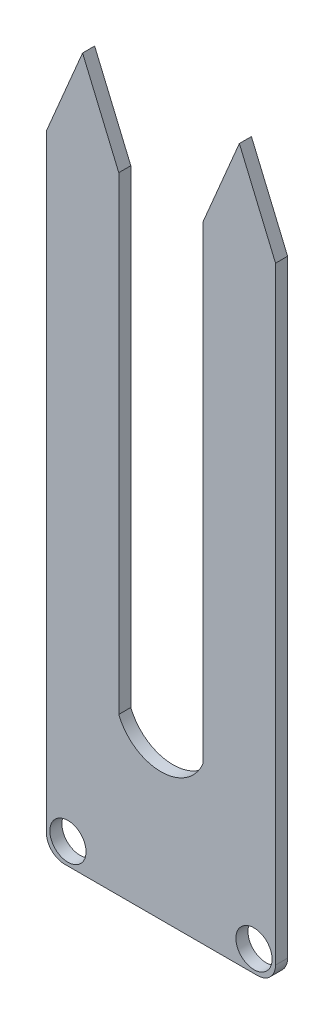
ISO-10303-21;
HEADER;
FILE_DESCRIPTION(('STEP AP214'),'2;1');
FILE_NAME('part.step','',(''),(''),'','','');
FILE_SCHEMA(('AUTOMOTIVE_DESIGN { 1 0 10303 214 1 1 1 1 }'));
ENDSEC;
DATA;
#1=APPLICATION_CONTEXT('core data for automotive mechanical design processes');
#2=APPLICATION_PROTOCOL_DEFINITION('international standard','automotive_design',2000,#1);
#3=PRODUCT_CONTEXT('',#1,'mechanical');
#4=PRODUCT('Part','Part','',(#3));
#5=PRODUCT_RELATED_PRODUCT_CATEGORY('part','',(#4));
#6=PRODUCT_DEFINITION_FORMATION('','',#4);
#7=PRODUCT_DEFINITION_CONTEXT('part definition',#1,'design');
#8=PRODUCT_DEFINITION('design','',#6,#7);
#9=PRODUCT_DEFINITION_SHAPE('','',#8);
#10=(LENGTH_UNIT() NAMED_UNIT(*) SI_UNIT(.MILLI.,.METRE.));
#11=(NAMED_UNIT(*) PLANE_ANGLE_UNIT() SI_UNIT($,.RADIAN.));
#12=(NAMED_UNIT(*) SI_UNIT($,.STERADIAN.) SOLID_ANGLE_UNIT());
#13=UNCERTAINTY_MEASURE_WITH_UNIT(LENGTH_MEASURE(1.E-05),#10,'distance_accuracy_value','');
#14=(GEOMETRIC_REPRESENTATION_CONTEXT(3) GLOBAL_UNCERTAINTY_ASSIGNED_CONTEXT((#13)) GLOBAL_UNIT_ASSIGNED_CONTEXT((#10,
#11,#12)) REPRESENTATION_CONTEXT('',''));
#15=CARTESIAN_POINT('',(0.,0.,0.));
#16=DIRECTION('',(0.,0.,1.));
#17=DIRECTION('',(1.,0.,0.));
#18=AXIS2_PLACEMENT_3D('',#15,#16,#17);
#19=CARTESIAN_POINT('',(-0.939393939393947,-18.4006283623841,1.));
#20=DIRECTION('',(0.,0.,1.));
#21=DIRECTION('',(1.,0.,0.));
#22=AXIS2_PLACEMENT_3D('',#19,#20,#21);
#23=PLANE('',#22);
#24=CARTESIAN_POINT('',(-8.65222968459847,-31.0226398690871,1.));
#25=DIRECTION('',(0.,0.,1.));
#26=DIRECTION('',(1.,0.,0.));
#27=AXIS2_PLACEMENT_3D('',#24,#25,#26);
#28=CIRCLE('',#27,1.50057310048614);
#29=CARTESIAN_POINT('',(-7.15165658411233,-31.0226398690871,1.));
#30=VERTEX_POINT('',#29);
#31=EDGE_CURVE('E158',#30,#30,#28,.T.);
#32=ORIENTED_EDGE('',*,*,#31,.F.);
#33=EDGE_LOOP('',(#32));
#34=FACE_BOUND('',#33,.T.);
#35=DIRECTION('',(0.,-1.,0.));
#36=VECTOR('',#35,1.);
#37=CARTESIAN_POINT('',(-10.4393939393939,-19.8030303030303,1.));
#38=LINE('',#37,#36);
#39=CARTESIAN_POINT('',(-10.4393939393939,19.1012573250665,1.));
#40=VERTEX_POINT('',#39);
#41=CARTESIAN_POINT('',(-10.4393939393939,-31.3030303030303,1.));
#42=VERTEX_POINT('',#41);
#43=EDGE_CURVE('E106',#40,#42,#38,.T.);
#44=ORIENTED_EDGE('',*,*,#43,.T.);
#45=CARTESIAN_POINT('',(-8.93939393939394,-31.3030303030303,1.));
#46=DIRECTION('',(0.,0.,1.));
#47=DIRECTION('',(1.,0.,0.));
#48=AXIS2_PLACEMENT_3D('',#45,#46,#47);
#49=CIRCLE('',#48,1.5);
#50=CARTESIAN_POINT('',(-8.93939393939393,-32.8030303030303,1.));
#51=VERTEX_POINT('',#50);
#52=EDGE_CURVE('E247',#42,#51,#49,.T.);
#53=ORIENTED_EDGE('',*,*,#52,.T.);
#54=DIRECTION('',(1.,0.,0.));
#55=VECTOR('',#54,1.);
#56=CARTESIAN_POINT('',(-8.93939393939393,-32.8030303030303,1.));
#57=LINE('',#56,#55);
#58=CARTESIAN_POINT('',(7.06060606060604,-32.8030303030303,1.));
#59=VERTEX_POINT('',#58);
#60=EDGE_CURVE('E207',#51,#59,#57,.T.);
#61=ORIENTED_EDGE('',*,*,#60,.T.);
#62=CARTESIAN_POINT('',(7.06060606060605,-31.3030303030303,1.));
#63=DIRECTION('',(0.,0.,1.));
#64=DIRECTION('',(1.,0.,0.));
#65=AXIS2_PLACEMENT_3D('',#62,#63,#64);
#66=CIRCLE('',#65,1.5);
#67=CARTESIAN_POINT('',(8.56060606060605,-31.3030303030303,1.));
#68=VERTEX_POINT('',#67);
#69=EDGE_CURVE('E225',#59,#68,#66,.T.);
#70=ORIENTED_EDGE('',*,*,#69,.T.);
#71=DIRECTION('',(0.,1.,0.));
#72=VECTOR('',#71,1.);
#73=CARTESIAN_POINT('',(8.56060606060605,-19.8030303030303,1.));
#74=LINE('',#73,#72);
#75=CARTESIAN_POINT('',(8.56060606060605,19.1012573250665,1.));
#76=VERTEX_POINT('',#75);
#77=EDGE_CURVE('E222',#68,#76,#74,.T.);
#78=ORIENTED_EDGE('',*,*,#77,.T.);
#79=DIRECTION('',(-0.389416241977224,0.921061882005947,0.));
#80=VECTOR('',#79,1.);
#81=CARTESIAN_POINT('',(8.56060606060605,19.1012573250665,1.));
#82=LINE('',#81,#80);
#83=CARTESIAN_POINT('',(5.56060606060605,26.1969696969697,1.));
#84=VERTEX_POINT('',#83);
#85=EDGE_CURVE('E224',#76,#84,#82,.T.);
#86=ORIENTED_EDGE('',*,*,#85,.T.);
#87=DIRECTION('',(-0.389416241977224,-0.921061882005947,0.));
#88=VECTOR('',#87,1.);
#89=CARTESIAN_POINT('',(5.56060606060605,26.1969696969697,1.));
#90=LINE('',#89,#88);
#91=CARTESIAN_POINT('',(2.56060606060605,19.1012573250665,1.));
#92=VERTEX_POINT('',#91);
#93=EDGE_CURVE('E227',#84,#92,#90,.T.);
#94=ORIENTED_EDGE('',*,*,#93,.T.);
#95=DIRECTION('',(0.,-1.,0.));
#96=VECTOR('',#95,1.);
#97=CARTESIAN_POINT('',(2.56060606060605,-19.8030303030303,1.));
#98=LINE('',#97,#96);
#99=CARTESIAN_POINT('',(2.56060606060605,-19.8030303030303,1.));
#100=VERTEX_POINT('',#99);
#101=EDGE_CURVE('E233',#92,#100,#98,.T.);
#102=ORIENTED_EDGE('',*,*,#101,.T.);
#103=CARTESIAN_POINT('',(-0.939393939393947,-18.4006283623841,1.));
#104=DIRECTION('',(0.,0.,-1.));
#105=DIRECTION('',(1.,0.,0.));
#106=AXIS2_PLACEMENT_3D('',#103,#104,#105);
#107=CIRCLE('',#106,3.77050808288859);
#108=CARTESIAN_POINT('',(-4.43939393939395,-19.8030303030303,1.));
#109=VERTEX_POINT('',#108);
#110=EDGE_CURVE('E138',#100,#109,#107,.T.);
#111=ORIENTED_EDGE('',*,*,#110,.T.);
#112=DIRECTION('',(0.,1.,0.));
#113=VECTOR('',#112,1.);
#114=CARTESIAN_POINT('',(-4.43939393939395,-19.8030303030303,1.));
#115=LINE('',#114,#113);
#116=CARTESIAN_POINT('',(-4.43939393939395,19.1012573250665,1.));
#117=VERTEX_POINT('',#116);
#118=EDGE_CURVE('E132',#109,#117,#115,.T.);
#119=ORIENTED_EDGE('',*,*,#118,.T.);
#120=DIRECTION('',(-0.389416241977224,0.921061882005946,0.));
#121=VECTOR('',#120,1.);
#122=CARTESIAN_POINT('',(-4.43939393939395,19.1012573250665,1.));
#123=LINE('',#122,#121);
#124=CARTESIAN_POINT('',(-7.43939393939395,26.1969696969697,1.));
#125=VERTEX_POINT('',#124);
#126=EDGE_CURVE('E136',#117,#125,#123,.T.);
#127=ORIENTED_EDGE('',*,*,#126,.T.);
#128=DIRECTION('',(-0.389416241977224,-0.921061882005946,0.));
#129=VECTOR('',#128,1.);
#130=CARTESIAN_POINT('',(-7.43939393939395,26.1969696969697,1.));
#131=LINE('',#130,#129);
#132=EDGE_CURVE('E52',#125,#40,#131,.T.);
#133=ORIENTED_EDGE('',*,*,#132,.T.);
#134=EDGE_LOOP('',(#44,#53,#61,#70,#78,#86,#94,#102,#111,#119,#127,#133));
#135=FACE_BOUND('',#134,.T.);
#136=CARTESIAN_POINT('',(6.77344180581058,-31.0226398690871,1.));
#137=DIRECTION('',(0.,0.,1.));
#138=DIRECTION('',(-1.,0.,0.));
#139=AXIS2_PLACEMENT_3D('',#136,#137,#138);
#140=CIRCLE('',#139,1.50057310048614);
#141=CARTESIAN_POINT('',(5.27286870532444,-31.0226398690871,1.));
#142=VERTEX_POINT('',#141);
#143=EDGE_CURVE('E399',#142,#142,#140,.T.);
#144=ORIENTED_EDGE('',*,*,#143,.F.);
#145=EDGE_LOOP('',(#144));
#146=FACE_BOUND('',#145,.T.);
#147=ADVANCED_FACE('F35',(#34,#135,#146),#23,.T.);
#148=CARTESIAN_POINT('',(-0.939393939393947,-18.4006283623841,0.));
#149=DIRECTION('',(0.,0.,1.));
#150=DIRECTION('',(1.,0.,0.));
#151=AXIS2_PLACEMENT_3D('',#148,#149,#150);
#152=PLANE('',#151);
#153=DIRECTION('',(0.,-1.,0.));
#154=VECTOR('',#153,1.);
#155=CARTESIAN_POINT('',(-10.4393939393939,-19.8030303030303,0.));
#156=LINE('',#155,#154);
#157=CARTESIAN_POINT('',(-10.4393939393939,19.1012573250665,0.));
#158=VERTEX_POINT('',#157);
#159=CARTESIAN_POINT('',(-10.4393939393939,-31.3030303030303,0.));
#160=VERTEX_POINT('',#159);
#161=EDGE_CURVE('E100',#158,#160,#156,.T.);
#162=ORIENTED_EDGE('',*,*,#161,.F.);
#163=DIRECTION('',(-0.389416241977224,-0.921061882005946,0.));
#164=VECTOR('',#163,1.);
#165=CARTESIAN_POINT('',(-7.43939393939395,26.1969696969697,0.));
#166=LINE('',#165,#164);
#167=CARTESIAN_POINT('',(-7.43939393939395,26.1969696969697,0.));
#168=VERTEX_POINT('',#167);
#169=EDGE_CURVE('E177',#168,#158,#166,.T.);
#170=ORIENTED_EDGE('',*,*,#169,.F.);
#171=DIRECTION('',(-0.389416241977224,0.921061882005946,0.));
#172=VECTOR('',#171,1.);
#173=CARTESIAN_POINT('',(-4.43939393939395,19.1012573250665,0.));
#174=LINE('',#173,#172);
#175=CARTESIAN_POINT('',(-4.43939393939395,19.1012573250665,0.));
#176=VERTEX_POINT('',#175);
#177=EDGE_CURVE('E93',#176,#168,#174,.T.);
#178=ORIENTED_EDGE('',*,*,#177,.F.);
#179=DIRECTION('',(0.,1.,0.));
#180=VECTOR('',#179,1.);
#181=CARTESIAN_POINT('',(-4.43939393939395,-19.8030303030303,0.));
#182=LINE('',#181,#180);
#183=CARTESIAN_POINT('',(-4.43939393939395,-19.8030303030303,0.));
#184=VERTEX_POINT('',#183);
#185=EDGE_CURVE('E146',#184,#176,#182,.T.);
#186=ORIENTED_EDGE('',*,*,#185,.F.);
#187=CARTESIAN_POINT('',(-0.939393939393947,-18.4006283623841,0.));
#188=DIRECTION('',(0.,0.,-1.));
#189=DIRECTION('',(1.,0.,0.));
#190=AXIS2_PLACEMENT_3D('',#187,#188,#189);
#191=CIRCLE('',#190,3.77050808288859);
#192=CARTESIAN_POINT('',(2.56060606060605,-19.8030303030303,0.));
#193=VERTEX_POINT('',#192);
#194=EDGE_CURVE('E173',#193,#184,#191,.T.);
#195=ORIENTED_EDGE('',*,*,#194,.F.);
#196=DIRECTION('',(0.,-1.,0.));
#197=VECTOR('',#196,1.);
#198=CARTESIAN_POINT('',(2.56060606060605,-19.8030303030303,0.));
#199=LINE('',#198,#197);
#200=CARTESIAN_POINT('',(2.56060606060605,19.1012573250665,0.));
#201=VERTEX_POINT('',#200);
#202=EDGE_CURVE('E171',#201,#193,#199,.T.);
#203=ORIENTED_EDGE('',*,*,#202,.F.);
#204=DIRECTION('',(-0.389416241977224,-0.921061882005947,0.));
#205=VECTOR('',#204,1.);
#206=CARTESIAN_POINT('',(5.56060606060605,26.1969696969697,0.));
#207=LINE('',#206,#205);
#208=CARTESIAN_POINT('',(5.56060606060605,26.1969696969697,0.));
#209=VERTEX_POINT('',#208);
#210=EDGE_CURVE('E169',#209,#201,#207,.T.);
#211=ORIENTED_EDGE('',*,*,#210,.F.);
#212=DIRECTION('',(-0.389416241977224,0.921061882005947,0.));
#213=VECTOR('',#212,1.);
#214=CARTESIAN_POINT('',(8.56060606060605,19.1012573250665,0.));
#215=LINE('',#214,#213);
#216=CARTESIAN_POINT('',(8.56060606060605,19.1012573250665,0.));
#217=VERTEX_POINT('',#216);
#218=EDGE_CURVE('E167',#217,#209,#215,.T.);
#219=ORIENTED_EDGE('',*,*,#218,.F.);
#220=DIRECTION('',(0.,1.,0.));
#221=VECTOR('',#220,1.);
#222=CARTESIAN_POINT('',(8.56060606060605,-19.8030303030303,0.));
#223=LINE('',#222,#221);
#224=CARTESIAN_POINT('',(8.56060606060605,-31.3030303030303,0.));
#225=VERTEX_POINT('',#224);
#226=EDGE_CURVE('E165',#225,#217,#223,.T.);
#227=ORIENTED_EDGE('',*,*,#226,.F.);
#228=CARTESIAN_POINT('',(7.06060606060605,-31.3030303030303,0.));
#229=DIRECTION('',(0.,0.,1.));
#230=DIRECTION('',(1.,0.,0.));
#231=AXIS2_PLACEMENT_3D('',#228,#229,#230);
#232=CIRCLE('',#231,1.5);
#233=CARTESIAN_POINT('',(7.06060606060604,-32.8030303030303,0.));
#234=VERTEX_POINT('',#233);
#235=EDGE_CURVE('E162',#234,#225,#232,.T.);
#236=ORIENTED_EDGE('',*,*,#235,.F.);
#237=DIRECTION('',(1.,0.,0.));
#238=VECTOR('',#237,1.);
#239=CARTESIAN_POINT('',(-8.93939393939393,-32.8030303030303,0.));
#240=LINE('',#239,#238);
#241=CARTESIAN_POINT('',(-8.93939393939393,-32.8030303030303,0.));
#242=VERTEX_POINT('',#241);
#243=EDGE_CURVE('E160',#242,#234,#240,.T.);
#244=ORIENTED_EDGE('',*,*,#243,.F.);
#245=CARTESIAN_POINT('',(-8.93939393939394,-31.3030303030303,0.));
#246=DIRECTION('',(0.,0.,1.));
#247=DIRECTION('',(1.,0.,0.));
#248=AXIS2_PLACEMENT_3D('',#245,#246,#247);
#249=CIRCLE('',#248,1.5);
#250=EDGE_CURVE('E157',#160,#242,#249,.T.);
#251=ORIENTED_EDGE('',*,*,#250,.F.);
#252=EDGE_LOOP('',(#162,#170,#178,#186,#195,#203,#211,#219,#227,#236,#244,#251));
#253=FACE_BOUND('',#252,.T.);
#254=CARTESIAN_POINT('',(-8.65222968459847,-31.0226398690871,0.));
#255=DIRECTION('',(0.,0.,1.));
#256=DIRECTION('',(1.,0.,0.));
#257=AXIS2_PLACEMENT_3D('',#254,#255,#256);
#258=CIRCLE('',#257,1.50057310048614);
#259=CARTESIAN_POINT('',(-7.15165658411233,-31.0226398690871,0.));
#260=VERTEX_POINT('',#259);
#261=EDGE_CURVE('E251',#260,#260,#258,.T.);
#262=ORIENTED_EDGE('',*,*,#261,.T.);
#263=EDGE_LOOP('',(#262));
#264=FACE_BOUND('',#263,.T.);
#265=CARTESIAN_POINT('',(6.77344180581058,-31.0226398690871,0.));
#266=DIRECTION('',(0.,0.,1.));
#267=DIRECTION('',(-1.,0.,0.));
#268=AXIS2_PLACEMENT_3D('',#265,#266,#267);
#269=CIRCLE('',#268,1.50057310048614);
#270=CARTESIAN_POINT('',(5.27286870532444,-31.0226398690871,0.));
#271=VERTEX_POINT('',#270);
#272=EDGE_CURVE('E402',#271,#271,#269,.T.);
#273=ORIENTED_EDGE('',*,*,#272,.T.);
#274=EDGE_LOOP('',(#273));
#275=FACE_BOUND('',#274,.T.);
#276=ADVANCED_FACE('F211',(#253,#264,#275),#152,.F.);
#277=CARTESIAN_POINT('',(-10.4393939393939,-19.8030303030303,1.));
#278=DIRECTION('',(1.,0.,0.));
#279=DIRECTION('',(0.,1.,0.));
#280=AXIS2_PLACEMENT_3D('',#277,#278,#279);
#281=PLANE('',#280);
#282=ORIENTED_EDGE('',*,*,#161,.T.);
#283=DIRECTION('',(0.,0.,-1.));
#284=VECTOR('',#283,1.);
#285=CARTESIAN_POINT('',(-10.4393939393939,-31.3030303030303,1.));
#286=LINE('',#285,#284);
#287=EDGE_CURVE('E11',#42,#160,#286,.T.);
#288=ORIENTED_EDGE('',*,*,#287,.F.);
#289=ORIENTED_EDGE('',*,*,#43,.F.);
#290=DIRECTION('',(0.,0.,-1.));
#291=VECTOR('',#290,1.);
#292=CARTESIAN_POINT('',(-10.4393939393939,19.1012573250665,1.));
#293=LINE('',#292,#291);
#294=EDGE_CURVE('E152',#40,#158,#293,.T.);
#295=ORIENTED_EDGE('',*,*,#294,.T.);
#296=EDGE_LOOP('',(#282,#288,#289,#295));
#297=FACE_BOUND('',#296,.T.);
#298=ADVANCED_FACE('F37',(#297),#281,.F.);
#299=CARTESIAN_POINT('',(-8.93939393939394,-31.3030303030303,1.));
#300=DIRECTION('',(0.,0.,-1.));
#301=DIRECTION('',(-1.,0.,0.));
#302=AXIS2_PLACEMENT_3D('',#299,#300,#301);
#303=CYLINDRICAL_SURFACE('',#302,1.5);
#304=ORIENTED_EDGE('',*,*,#250,.T.);
#305=DIRECTION('',(0.,0.,-1.));
#306=VECTOR('',#305,1.);
#307=CARTESIAN_POINT('',(-8.93939393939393,-32.8030303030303,1.));
#308=LINE('',#307,#306);
#309=EDGE_CURVE('E44',#51,#242,#308,.T.);
#310=ORIENTED_EDGE('',*,*,#309,.F.);
#311=ORIENTED_EDGE('',*,*,#52,.F.);
#312=ORIENTED_EDGE('',*,*,#287,.T.);
#313=EDGE_LOOP('',(#304,#310,#311,#312));
#314=FACE_BOUND('',#313,.T.);
#315=ADVANCED_FACE('F253',(#314),#303,.T.);
#316=CARTESIAN_POINT('',(-8.93939393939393,-32.8030303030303,1.));
#317=DIRECTION('',(0.,1.,0.));
#318=DIRECTION('',(0.,0.,1.));
#319=AXIS2_PLACEMENT_3D('',#316,#317,#318);
#320=PLANE('',#319);
#321=ORIENTED_EDGE('',*,*,#243,.T.);
#322=DIRECTION('',(0.,0.,-1.));
#323=VECTOR('',#322,1.);
#324=CARTESIAN_POINT('',(7.06060606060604,-32.8030303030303,1.));
#325=LINE('',#324,#323);
#326=EDGE_CURVE('E198',#59,#234,#325,.T.);
#327=ORIENTED_EDGE('',*,*,#326,.F.);
#328=ORIENTED_EDGE('',*,*,#60,.F.);
#329=ORIENTED_EDGE('',*,*,#309,.T.);
#330=EDGE_LOOP('',(#321,#327,#328,#329));
#331=FACE_BOUND('',#330,.T.);
#332=ADVANCED_FACE('F205',(#331),#320,.F.);
#333=CARTESIAN_POINT('',(7.06060606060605,-31.3030303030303,1.));
#334=DIRECTION('',(0.,0.,-1.));
#335=DIRECTION('',(-1.,0.,0.));
#336=AXIS2_PLACEMENT_3D('',#333,#334,#335);
#337=CYLINDRICAL_SURFACE('',#336,1.5);
#338=ORIENTED_EDGE('',*,*,#235,.T.);
#339=DIRECTION('',(0.,0.,-1.));
#340=VECTOR('',#339,1.);
#341=CARTESIAN_POINT('',(8.56060606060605,-31.3030303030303,1.));
#342=LINE('',#341,#340);
#343=EDGE_CURVE('E195',#68,#225,#342,.T.);
#344=ORIENTED_EDGE('',*,*,#343,.F.);
#345=ORIENTED_EDGE('',*,*,#69,.F.);
#346=ORIENTED_EDGE('',*,*,#326,.T.);
#347=EDGE_LOOP('',(#338,#344,#345,#346));
#348=FACE_BOUND('',#347,.T.);
#349=ADVANCED_FACE('F216',(#348),#337,.T.);
#350=CARTESIAN_POINT('',(8.56060606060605,-19.8030303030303,1.));
#351=DIRECTION('',(-1.,0.,0.));
#352=DIRECTION('',(0.,0.,1.));
#353=AXIS2_PLACEMENT_3D('',#350,#351,#352);
#354=PLANE('',#353);
#355=ORIENTED_EDGE('',*,*,#226,.T.);
#356=DIRECTION('',(0.,0.,-1.));
#357=VECTOR('',#356,1.);
#358=CARTESIAN_POINT('',(8.56060606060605,19.1012573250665,1.));
#359=LINE('',#358,#357);
#360=EDGE_CURVE('E192',#76,#217,#359,.T.);
#361=ORIENTED_EDGE('',*,*,#360,.F.);
#362=ORIENTED_EDGE('',*,*,#77,.F.);
#363=ORIENTED_EDGE('',*,*,#343,.T.);
#364=EDGE_LOOP('',(#355,#361,#362,#363));
#365=FACE_BOUND('',#364,.T.);
#366=ADVANCED_FACE('F220',(#365),#354,.F.);
#367=CARTESIAN_POINT('',(8.56060606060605,19.1012573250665,1.));
#368=DIRECTION('',(-0.921061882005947,-0.389416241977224,0.));
#369=DIRECTION('',(0.389416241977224,-0.921061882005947,0.));
#370=AXIS2_PLACEMENT_3D('',#367,#368,#369);
#371=PLANE('',#370);
#372=ORIENTED_EDGE('',*,*,#218,.T.);
#373=DIRECTION('',(0.,0.,-1.));
#374=VECTOR('',#373,1.);
#375=CARTESIAN_POINT('',(5.56060606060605,26.1969696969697,1.));
#376=LINE('',#375,#374);
#377=EDGE_CURVE('E189',#84,#209,#376,.T.);
#378=ORIENTED_EDGE('',*,*,#377,.F.);
#379=ORIENTED_EDGE('',*,*,#85,.F.);
#380=ORIENTED_EDGE('',*,*,#360,.T.);
#381=EDGE_LOOP('',(#372,#378,#379,#380));
#382=FACE_BOUND('',#381,.T.);
#383=ADVANCED_FACE('F285',(#382),#371,.F.);
#384=CARTESIAN_POINT('',(5.56060606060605,26.1969696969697,1.));
#385=DIRECTION('',(0.921061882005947,-0.389416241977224,0.));
#386=DIRECTION('',(0.389416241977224,0.921061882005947,0.));
#387=AXIS2_PLACEMENT_3D('',#384,#385,#386);
#388=PLANE('',#387);
#389=ORIENTED_EDGE('',*,*,#210,.T.);
#390=DIRECTION('',(0.,0.,-1.));
#391=VECTOR('',#390,1.);
#392=CARTESIAN_POINT('',(2.56060606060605,19.1012573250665,1.));
#393=LINE('',#392,#391);
#394=EDGE_CURVE('E186',#92,#201,#393,.T.);
#395=ORIENTED_EDGE('',*,*,#394,.F.);
#396=ORIENTED_EDGE('',*,*,#93,.F.);
#397=ORIENTED_EDGE('',*,*,#377,.T.);
#398=EDGE_LOOP('',(#389,#395,#396,#397));
#399=FACE_BOUND('',#398,.T.);
#400=ADVANCED_FACE('F282',(#399),#388,.F.);
#401=CARTESIAN_POINT('',(2.56060606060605,-19.8030303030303,1.));
#402=DIRECTION('',(1.,0.,0.));
#403=DIRECTION('',(0.,1.,0.));
#404=AXIS2_PLACEMENT_3D('',#401,#402,#403);
#405=PLANE('',#404);
#406=ORIENTED_EDGE('',*,*,#202,.T.);
#407=DIRECTION('',(0.,0.,-1.));
#408=VECTOR('',#407,1.);
#409=CARTESIAN_POINT('',(2.56060606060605,-19.8030303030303,1.));
#410=LINE('',#409,#408);
#411=EDGE_CURVE('E183',#100,#193,#410,.T.);
#412=ORIENTED_EDGE('',*,*,#411,.F.);
#413=ORIENTED_EDGE('',*,*,#101,.F.);
#414=ORIENTED_EDGE('',*,*,#394,.T.);
#415=EDGE_LOOP('',(#406,#412,#413,#414));
#416=FACE_BOUND('',#415,.T.);
#417=ADVANCED_FACE('F239',(#416),#405,.F.);
#418=CARTESIAN_POINT('',(-0.939393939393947,-18.4006283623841,1.));
#419=DIRECTION('',(0.,0.,-1.));
#420=DIRECTION('',(-1.,0.,0.));
#421=AXIS2_PLACEMENT_3D('',#418,#419,#420);
#422=CYLINDRICAL_SURFACE('',#421,3.77050808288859);
#423=ORIENTED_EDGE('',*,*,#194,.T.);
#424=DIRECTION('',(0.,0.,-1.));
#425=VECTOR('',#424,1.);
#426=CARTESIAN_POINT('',(-4.43939393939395,-19.8030303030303,1.));
#427=LINE('',#426,#425);
#428=EDGE_CURVE('E147',#109,#184,#427,.T.);
#429=ORIENTED_EDGE('',*,*,#428,.F.);
#430=ORIENTED_EDGE('',*,*,#110,.F.);
#431=ORIENTED_EDGE('',*,*,#411,.T.);
#432=EDGE_LOOP('',(#423,#429,#430,#431));
#433=FACE_BOUND('',#432,.T.);
#434=ADVANCED_FACE('F243',(#433),#422,.F.);
#435=CARTESIAN_POINT('',(-4.43939393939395,-19.8030303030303,1.));
#436=DIRECTION('',(-1.,0.,0.));
#437=DIRECTION('',(0.,0.,1.));
#438=AXIS2_PLACEMENT_3D('',#435,#436,#437);
#439=PLANE('',#438);
#440=ORIENTED_EDGE('',*,*,#185,.T.);
#441=DIRECTION('',(0.,0.,-1.));
#442=VECTOR('',#441,1.);
#443=CARTESIAN_POINT('',(-4.43939393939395,19.1012573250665,1.));
#444=LINE('',#443,#442);
#445=EDGE_CURVE('E143',#117,#176,#444,.T.);
#446=ORIENTED_EDGE('',*,*,#445,.F.);
#447=ORIENTED_EDGE('',*,*,#118,.F.);
#448=ORIENTED_EDGE('',*,*,#428,.T.);
#449=EDGE_LOOP('',(#440,#446,#447,#448));
#450=FACE_BOUND('',#449,.T.);
#451=ADVANCED_FACE('F144',(#450),#439,.F.);
#452=CARTESIAN_POINT('',(-4.43939393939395,19.1012573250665,1.));
#453=DIRECTION('',(-0.921061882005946,-0.389416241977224,0.));
#454=DIRECTION('',(0.389416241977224,-0.921061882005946,0.));
#455=AXIS2_PLACEMENT_3D('',#452,#453,#454);
#456=PLANE('',#455);
#457=ORIENTED_EDGE('',*,*,#177,.T.);
#458=DIRECTION('',(0.,0.,-1.));
#459=VECTOR('',#458,1.);
#460=CARTESIAN_POINT('',(-7.43939393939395,26.1969696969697,1.));
#461=LINE('',#460,#459);
#462=EDGE_CURVE('E148',#125,#168,#461,.T.);
#463=ORIENTED_EDGE('',*,*,#462,.F.);
#464=ORIENTED_EDGE('',*,*,#126,.F.);
#465=ORIENTED_EDGE('',*,*,#445,.T.);
#466=EDGE_LOOP('',(#457,#463,#464,#465));
#467=FACE_BOUND('',#466,.T.);
#468=ADVANCED_FACE('F150',(#467),#456,.F.);
#469=CARTESIAN_POINT('',(-7.43939393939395,26.1969696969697,1.));
#470=DIRECTION('',(0.921061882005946,-0.389416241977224,0.));
#471=DIRECTION('',(0.389416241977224,0.921061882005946,0.));
#472=AXIS2_PLACEMENT_3D('',#469,#470,#471);
#473=PLANE('',#472);
#474=ORIENTED_EDGE('',*,*,#169,.T.);
#475=ORIENTED_EDGE('',*,*,#294,.F.);
#476=ORIENTED_EDGE('',*,*,#132,.F.);
#477=ORIENTED_EDGE('',*,*,#462,.T.);
#478=EDGE_LOOP('',(#474,#475,#476,#477));
#479=FACE_BOUND('',#478,.T.);
#480=ADVANCED_FACE('F245',(#479),#473,.F.);
#481=CARTESIAN_POINT('',(-8.65222968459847,-31.0226398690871,1.));
#482=DIRECTION('',(0.,0.,-1.));
#483=DIRECTION('',(-1.,0.,0.));
#484=AXIS2_PLACEMENT_3D('',#481,#482,#483);
#485=CYLINDRICAL_SURFACE('',#484,1.50057310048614);
#486=ORIENTED_EDGE('',*,*,#31,.T.);
#487=EDGE_LOOP('',(#486));
#488=FACE_BOUND('',#487,.T.);
#489=ORIENTED_EDGE('',*,*,#261,.F.);
#490=EDGE_LOOP('',(#489));
#491=FACE_BOUND('',#490,.T.);
#492=ADVANCED_FACE('F269',(#488,#491),#485,.F.);
#493=CARTESIAN_POINT('',(6.77344180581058,-31.0226398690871,1.));
#494=DIRECTION('',(0.,0.,-1.));
#495=DIRECTION('',(-1.,0.,0.));
#496=AXIS2_PLACEMENT_3D('',#493,#494,#495);
#497=CYLINDRICAL_SURFACE('',#496,1.50057310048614);
#498=ORIENTED_EDGE('',*,*,#143,.T.);
#499=EDGE_LOOP('',(#498));
#500=FACE_BOUND('',#499,.T.);
#501=ORIENTED_EDGE('',*,*,#272,.F.);
#502=EDGE_LOOP('',(#501));
#503=FACE_BOUND('',#502,.T.);
#504=ADVANCED_FACE('F335',(#500,#503),#497,.F.);
#505=CLOSED_SHELL('',(#147,#276,#298,#315,#332,#349,#366,#383,#400,#417,#434,#451,#468,#480,
#492,#504));
#506=MANIFOLD_SOLID_BREP('B2',#505);
#507=ADVANCED_BREP_SHAPE_REPRESENTATION('',(#18,#506),#14);
#508=SHAPE_DEFINITION_REPRESENTATION(#9,#507);
ENDSEC;
END-ISO-10303-21;
